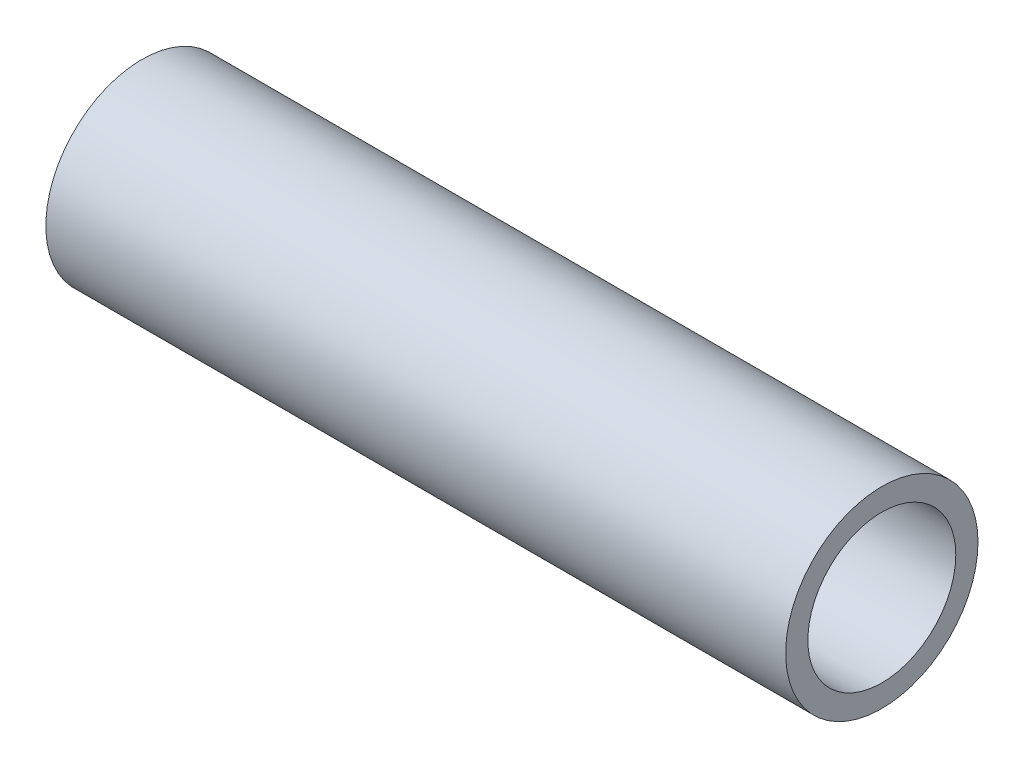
ISO-10303-21;
HEADER;
FILE_DESCRIPTION(('STEP AP214'),'2;1');
FILE_NAME('part.step','',(''),(''),'','','');
FILE_SCHEMA(('AUTOMOTIVE_DESIGN { 1 0 10303 214 1 1 1 1 }'));
ENDSEC;
DATA;
#1=APPLICATION_CONTEXT('core data for automotive mechanical design processes');
#2=APPLICATION_PROTOCOL_DEFINITION('international standard','automotive_design',2000,#1);
#3=PRODUCT_CONTEXT('',#1,'mechanical');
#4=PRODUCT('Part','Part','',(#3));
#5=PRODUCT_RELATED_PRODUCT_CATEGORY('part','',(#4));
#6=PRODUCT_DEFINITION_FORMATION('','',#4);
#7=PRODUCT_DEFINITION_CONTEXT('part definition',#1,'design');
#8=PRODUCT_DEFINITION('design','',#6,#7);
#9=PRODUCT_DEFINITION_SHAPE('','',#8);
#10=(LENGTH_UNIT() NAMED_UNIT(*) SI_UNIT(.MILLI.,.METRE.));
#11=(NAMED_UNIT(*) PLANE_ANGLE_UNIT() SI_UNIT($,.RADIAN.));
#12=(NAMED_UNIT(*) SI_UNIT($,.STERADIAN.) SOLID_ANGLE_UNIT());
#13=UNCERTAINTY_MEASURE_WITH_UNIT(LENGTH_MEASURE(1.E-05),#10,'distance_accuracy_value','');
#14=(GEOMETRIC_REPRESENTATION_CONTEXT(3) GLOBAL_UNCERTAINTY_ASSIGNED_CONTEXT((#13)) GLOBAL_UNIT_ASSIGNED_CONTEXT((#10,
#11,#12)) REPRESENTATION_CONTEXT('',''));
#15=CARTESIAN_POINT('',(0.,0.,0.));
#16=DIRECTION('',(0.,0.,1.));
#17=DIRECTION('',(1.,0.,0.));
#18=AXIS2_PLACEMENT_3D('',#15,#16,#17);
#19=CARTESIAN_POINT('',(127.,0.,0.));
#20=DIRECTION('',(-1.,0.,0.));
#21=DIRECTION('',(0.,0.,1.));
#22=AXIS2_PLACEMENT_3D('',#19,#20,#21);
#23=CYLINDRICAL_SURFACE('',#22,12.7);
#24=CARTESIAN_POINT('',(127.,0.,0.));
#25=DIRECTION('',(1.,0.,0.));
#26=DIRECTION('',(0.,0.,-1.));
#27=AXIS2_PLACEMENT_3D('',#24,#25,#26);
#28=CIRCLE('',#27,12.7);
#29=CARTESIAN_POINT('',(127.,0.,-12.7));
#30=VERTEX_POINT('',#29);
#31=EDGE_CURVE('E44',#30,#30,#28,.T.);
#32=ORIENTED_EDGE('',*,*,#31,.T.);
#33=EDGE_LOOP('',(#32));
#34=FACE_BOUND('',#33,.T.);
#35=CARTESIAN_POINT('',(0.,0.,0.));
#36=DIRECTION('',(1.,0.,0.));
#37=DIRECTION('',(0.,0.,-1.));
#38=AXIS2_PLACEMENT_3D('',#35,#36,#37);
#39=CIRCLE('',#38,12.7);
#40=CARTESIAN_POINT('',(0.,0.,-12.7));
#41=VERTEX_POINT('',#40);
#42=EDGE_CURVE('E50',#41,#41,#39,.T.);
#43=ORIENTED_EDGE('',*,*,#42,.F.);
#44=EDGE_LOOP('',(#43));
#45=FACE_BOUND('',#44,.T.);
#46=ADVANCED_FACE('F37',(#34,#45),#23,.F.);
#47=CARTESIAN_POINT('',(127.,0.,0.));
#48=DIRECTION('',(-1.,0.,0.));
#49=DIRECTION('',(0.,0.,1.));
#50=AXIS2_PLACEMENT_3D('',#47,#48,#49);
#51=CYLINDRICAL_SURFACE('',#50,16.51);
#52=CARTESIAN_POINT('',(127.,0.,0.));
#53=DIRECTION('',(1.,0.,0.));
#54=DIRECTION('',(0.,0.,-1.));
#55=AXIS2_PLACEMENT_3D('',#52,#53,#54);
#56=CIRCLE('',#55,16.51);
#57=CARTESIAN_POINT('',(127.,0.,-16.51));
#58=VERTEX_POINT('',#57);
#59=EDGE_CURVE('E10',#58,#58,#56,.T.);
#60=ORIENTED_EDGE('',*,*,#59,.F.);
#61=EDGE_LOOP('',(#60));
#62=FACE_BOUND('',#61,.T.);
#63=CARTESIAN_POINT('',(0.,0.,0.));
#64=DIRECTION('',(1.,0.,0.));
#65=DIRECTION('',(0.,0.,-1.));
#66=AXIS2_PLACEMENT_3D('',#63,#64,#65);
#67=CIRCLE('',#66,16.51);
#68=CARTESIAN_POINT('',(0.,0.,-16.51));
#69=VERTEX_POINT('',#68);
#70=EDGE_CURVE('E40',#69,#69,#67,.T.);
#71=ORIENTED_EDGE('',*,*,#70,.T.);
#72=EDGE_LOOP('',(#71));
#73=FACE_BOUND('',#72,.T.);
#74=ADVANCED_FACE('F57',(#62,#73),#51,.T.);
#75=CARTESIAN_POINT('',(127.,0.,0.));
#76=DIRECTION('',(1.,0.,0.));
#77=DIRECTION('',(0.,0.,-1.));
#78=AXIS2_PLACEMENT_3D('',#75,#76,#77);
#79=PLANE('',#78);
#80=ORIENTED_EDGE('',*,*,#31,.F.);
#81=EDGE_LOOP('',(#80));
#82=FACE_BOUND('',#81,.T.);
#83=ORIENTED_EDGE('',*,*,#59,.T.);
#84=EDGE_LOOP('',(#83));
#85=FACE_BOUND('',#84,.T.);
#86=ADVANCED_FACE('F61',(#82,#85),#79,.T.);
#87=CARTESIAN_POINT('',(0.,0.,0.));
#88=DIRECTION('',(1.,0.,0.));
#89=DIRECTION('',(0.,0.,-1.));
#90=AXIS2_PLACEMENT_3D('',#87,#88,#89);
#91=PLANE('',#90);
#92=ORIENTED_EDGE('',*,*,#42,.T.);
#93=EDGE_LOOP('',(#92));
#94=FACE_BOUND('',#93,.T.);
#95=ORIENTED_EDGE('',*,*,#70,.F.);
#96=EDGE_LOOP('',(#95));
#97=FACE_BOUND('',#96,.T.);
#98=ADVANCED_FACE('F59',(#94,#97),#91,.F.);
#99=CLOSED_SHELL('',(#46,#74,#86,#98));
#100=MANIFOLD_SOLID_BREP('B2',#99);
#101=ADVANCED_BREP_SHAPE_REPRESENTATION('',(#18,#100),#14);
#102=SHAPE_DEFINITION_REPRESENTATION(#9,#101);
ENDSEC;
END-ISO-10303-21;
